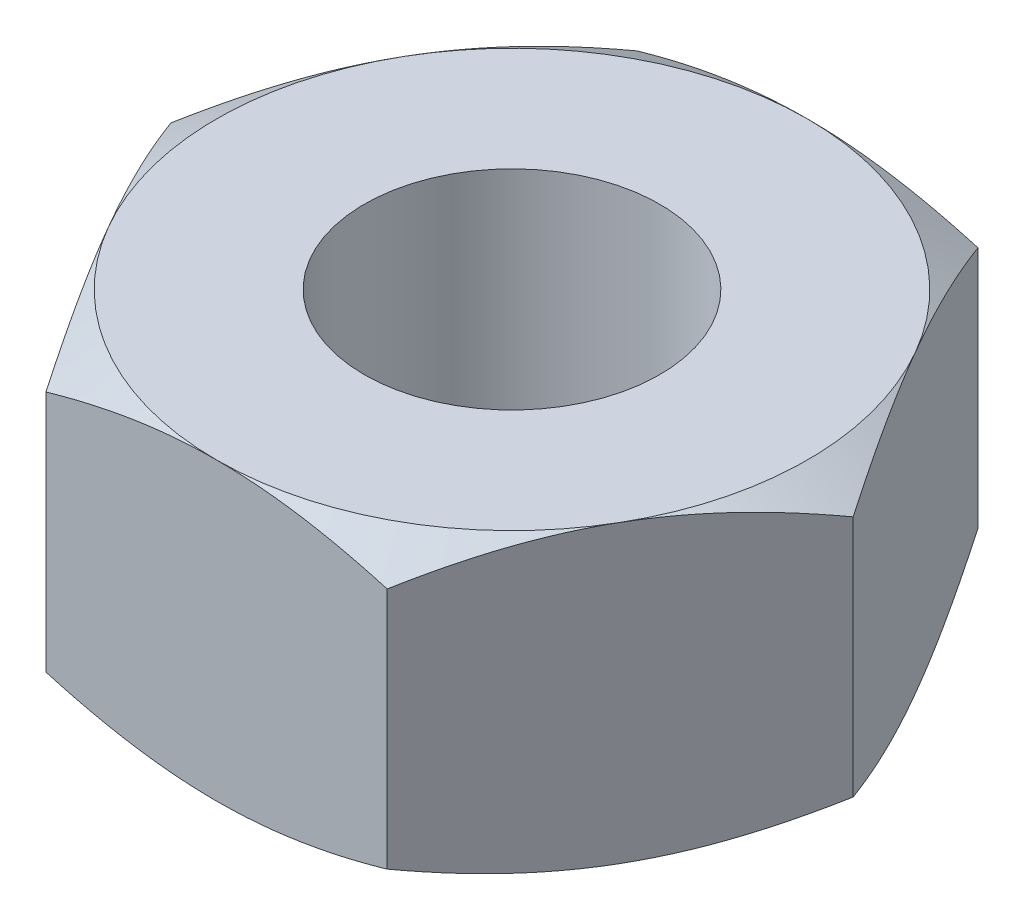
from build123d import *

# Parameters (mm, degrees)
EXTRUSION1_DEPTH        = 2.5
ESQUISSE3_R             = 2.5
ENL_V_MAT_EXTRU_1_DEPTH = 10.128709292


with BuildPart() as part:
    # Esquisse1 → Extrusion1 (new, symmetric)
    with BuildSketch(Plane(origin=(0, 0, 0), x_dir=(1, 0, 0), z_dir=(0, 1, 0))):
        Polygon((5.773502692, 0), (2.886751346, 5), (-2.886751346, 5), (-5.773502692, 0), (-2.886751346, -5), (2.886751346, -5), align=None)
    extrude(amount=EXTRUSION1_DEPTH, both=True)

    # Esquisse2 → Enl_vement de mati_re-R_volution4 (revolve, cut)
    with BuildSketch(Plane(origin=(0, 0, 0), x_dir=(0, 0, -1), z_dir=(1, 0, 0))):
        Polygon((2, 4.232050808), (8, 4.232050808), (8, 0.767949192), align=None)
    enl_vement_de_mati_re_r_volution4 = revolve(axis=Axis((0, 9.378046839, 0), (0, -1, 0)), mode=Mode.SUBTRACT)

    # Sym_trie1: Enl_vement de mati_re-R_volution4 across plane
    add(enl_vement_de_mati_re_r_volution4.mirror(Plane.ZX), mode=Mode.SUBTRACT)

    # Esquisse3 → Enl_v. mat.-Extru.1 (cut, through all)
    with BuildSketch(Plane(origin=(0, 2.5, 0), x_dir=(-1, 0, 0), z_dir=(0, 1, 0))):
        with Locations(Location((0, 0, 0), (0, 0, 90))):
            Circle(ESQUISSE3_R)
    extrude(amount=-ENL_V_MAT_EXTRU_1_DEPTH, mode=Mode.SUBTRACT)


solid = part.part
